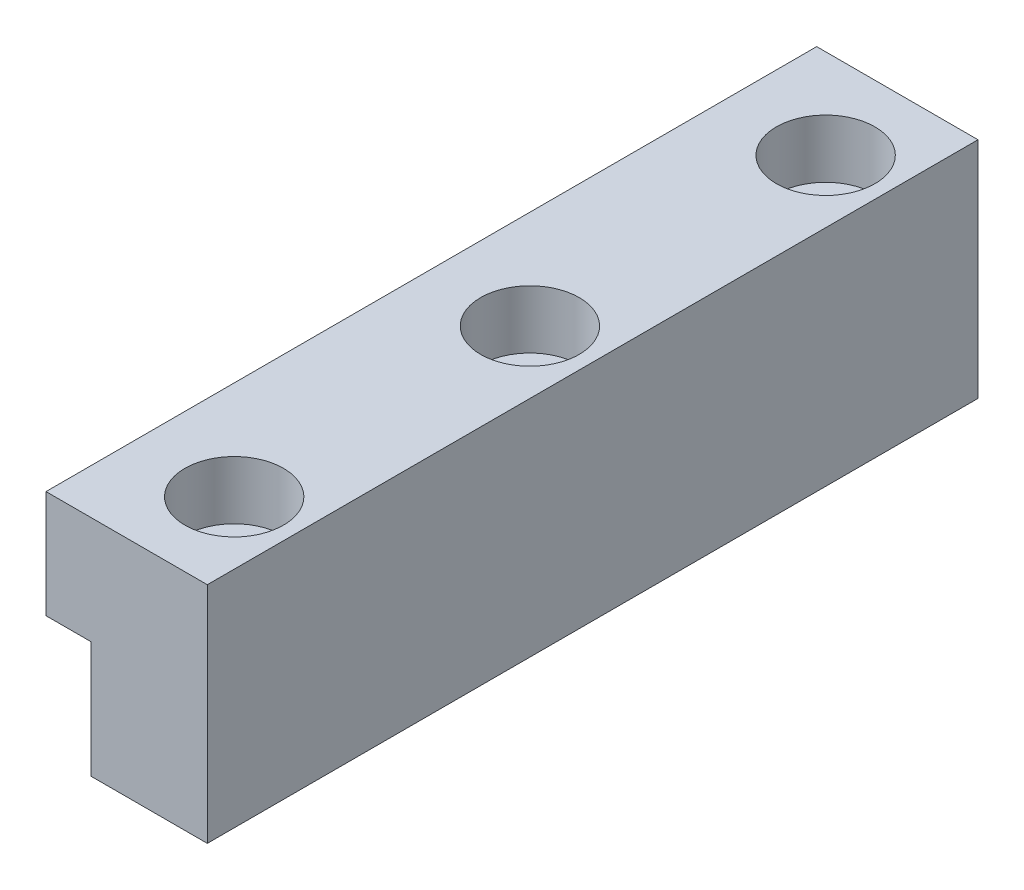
ISO-10303-21;
HEADER;
FILE_DESCRIPTION(('STEP AP214'),'2;1');
FILE_NAME('part.step','',(''),(''),'','','');
FILE_SCHEMA(('AUTOMOTIVE_DESIGN { 1 0 10303 214 1 1 1 1 }'));
ENDSEC;
DATA;
#1=APPLICATION_CONTEXT('core data for automotive mechanical design processes');
#2=APPLICATION_PROTOCOL_DEFINITION('international standard','automotive_design',2000,#1);
#3=PRODUCT_CONTEXT('',#1,'mechanical');
#4=PRODUCT('Part','Part','',(#3));
#5=PRODUCT_RELATED_PRODUCT_CATEGORY('part','',(#4));
#6=PRODUCT_DEFINITION_FORMATION('','',#4);
#7=PRODUCT_DEFINITION_CONTEXT('part definition',#1,'design');
#8=PRODUCT_DEFINITION('design','',#6,#7);
#9=PRODUCT_DEFINITION_SHAPE('','',#8);
#10=(LENGTH_UNIT() NAMED_UNIT(*) SI_UNIT(.MILLI.,.METRE.));
#11=(NAMED_UNIT(*) PLANE_ANGLE_UNIT() SI_UNIT($,.RADIAN.));
#12=(NAMED_UNIT(*) SI_UNIT($,.STERADIAN.) SOLID_ANGLE_UNIT());
#13=UNCERTAINTY_MEASURE_WITH_UNIT(LENGTH_MEASURE(1.E-05),#10,'distance_accuracy_value','');
#14=(GEOMETRIC_REPRESENTATION_CONTEXT(3) GLOBAL_UNCERTAINTY_ASSIGNED_CONTEXT((#13)) GLOBAL_UNIT_ASSIGNED_CONTEXT((#10,
#11,#12)) REPRESENTATION_CONTEXT('',''));
#15=CARTESIAN_POINT('',(0.,0.,0.));
#16=DIRECTION('',(0.,0.,1.));
#17=DIRECTION('',(1.,0.,0.));
#18=AXIS2_PLACEMENT_3D('',#15,#16,#17);
#19=CARTESIAN_POINT('',(51.,-6.5,-32.));
#20=DIRECTION('',(0.,1.,0.));
#21=DIRECTION('',(-1.,0.,0.));
#22=AXIS2_PLACEMENT_3D('',#19,#20,#21);
#23=CYLINDRICAL_SURFACE('',#22,5.5);
#24=CARTESIAN_POINT('',(51.,-6.5,-32.));
#25=DIRECTION('',(0.,1.,0.));
#26=DIRECTION('',(-1.,0.,0.));
#27=AXIS2_PLACEMENT_3D('',#24,#25,#26);
#28=CIRCLE('',#27,5.5);
#29=CARTESIAN_POINT('',(45.5,-6.5,-32.));
#30=VERTEX_POINT('',#29);
#31=EDGE_CURVE('E28',#30,#30,#28,.F.);
#32=ORIENTED_EDGE('',*,*,#31,.T.);
#33=EDGE_LOOP('',(#32));
#34=FACE_BOUND('',#33,.T.);
#35=CARTESIAN_POINT('',(51.,0.,-32.));
#36=DIRECTION('',(0.,1.,0.));
#37=DIRECTION('',(-1.,0.,0.));
#38=AXIS2_PLACEMENT_3D('',#35,#36,#37);
#39=CIRCLE('',#38,5.5);
#40=CARTESIAN_POINT('',(45.5,0.,-32.));
#41=VERTEX_POINT('',#40);
#42=EDGE_CURVE('E91',#41,#41,#39,.F.);
#43=ORIENTED_EDGE('',*,*,#42,.F.);
#44=EDGE_LOOP('',(#43));
#45=FACE_BOUND('',#44,.T.);
#46=ADVANCED_FACE('F24',(#34,#45),#23,.F.);
#47=CARTESIAN_POINT('',(51.,-6.5,-65.));
#48=DIRECTION('',(0.,1.,0.));
#49=DIRECTION('',(-1.,0.,0.));
#50=AXIS2_PLACEMENT_3D('',#47,#48,#49);
#51=CYLINDRICAL_SURFACE('',#50,5.50000000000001);
#52=CARTESIAN_POINT('',(51.,-6.5,-65.));
#53=DIRECTION('',(0.,1.,0.));
#54=DIRECTION('',(-1.,0.,0.));
#55=AXIS2_PLACEMENT_3D('',#52,#53,#54);
#56=CIRCLE('',#55,5.50000000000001);
#57=CARTESIAN_POINT('',(45.5,-6.5,-65.));
#58=VERTEX_POINT('',#57);
#59=EDGE_CURVE('E92',#58,#58,#56,.F.);
#60=ORIENTED_EDGE('',*,*,#59,.T.);
#61=EDGE_LOOP('',(#60));
#62=FACE_BOUND('',#61,.T.);
#63=CARTESIAN_POINT('',(51.,0.,-65.));
#64=DIRECTION('',(0.,1.,0.));
#65=DIRECTION('',(-1.,0.,0.));
#66=AXIS2_PLACEMENT_3D('',#63,#64,#65);
#67=CIRCLE('',#66,5.50000000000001);
#68=CARTESIAN_POINT('',(45.5,0.,-65.));
#69=VERTEX_POINT('',#68);
#70=EDGE_CURVE('E107',#69,#69,#67,.F.);
#71=ORIENTED_EDGE('',*,*,#70,.F.);
#72=EDGE_LOOP('',(#71));
#73=FACE_BOUND('',#72,.T.);
#74=ADVANCED_FACE('F185',(#62,#73),#51,.F.);
#75=CARTESIAN_POINT('',(40.,0.,-108.));
#76=DIRECTION('',(-1.,0.,0.));
#77=DIRECTION('',(0.,-1.,0.));
#78=AXIS2_PLACEMENT_3D('',#75,#76,#77);
#79=PLANE('',#78);
#80=DIRECTION('',(0.,-1.,0.));
#81=VECTOR('',#80,1.);
#82=CARTESIAN_POINT('',(40.,-12.5,-108.));
#83=LINE('',#82,#81);
#84=CARTESIAN_POINT('',(40.,0.,-108.));
#85=VERTEX_POINT('',#84);
#86=CARTESIAN_POINT('',(40.,-12.,-108.));
#87=VERTEX_POINT('',#86);
#88=EDGE_CURVE('E85',#85,#87,#83,.T.);
#89=ORIENTED_EDGE('',*,*,#88,.T.);
#90=DIRECTION('',(0.,0.,-1.));
#91=VECTOR('',#90,1.);
#92=CARTESIAN_POINT('',(40.,-12.,-65.));
#93=LINE('',#92,#91);
#94=CARTESIAN_POINT('',(40.,-12.,-22.));
#95=VERTEX_POINT('',#94);
#96=EDGE_CURVE('E76',#95,#87,#93,.T.);
#97=ORIENTED_EDGE('',*,*,#96,.F.);
#98=DIRECTION('',(0.,-1.,0.));
#99=VECTOR('',#98,1.);
#100=CARTESIAN_POINT('',(40.,-12.5,-22.));
#101=LINE('',#100,#99);
#102=CARTESIAN_POINT('',(40.,0.,-22.));
#103=VERTEX_POINT('',#102);
#104=EDGE_CURVE('E86',#103,#95,#101,.T.);
#105=ORIENTED_EDGE('',*,*,#104,.F.);
#106=DIRECTION('',(0.,0.,1.));
#107=VECTOR('',#106,1.);
#108=CARTESIAN_POINT('',(40.,0.,-65.));
#109=LINE('',#108,#107);
#110=EDGE_CURVE('E82',#85,#103,#109,.T.);
#111=ORIENTED_EDGE('',*,*,#110,.F.);
#112=EDGE_LOOP('',(#89,#97,#105,#111));
#113=FACE_BOUND('',#112,.T.);
#114=ADVANCED_FACE('F84',(#113),#79,.T.);
#115=CARTESIAN_POINT('',(40.,-12.,-108.));
#116=DIRECTION('',(0.,-1.,0.));
#117=DIRECTION('',(1.,0.,0.));
#118=AXIS2_PLACEMENT_3D('',#115,#116,#117);
#119=PLANE('',#118);
#120=DIRECTION('',(1.,0.,0.));
#121=VECTOR('',#120,1.);
#122=CARTESIAN_POINT('',(49.,-12.,-108.));
#123=LINE('',#122,#121);
#124=CARTESIAN_POINT('',(45.000000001,-12.,-108.));
#125=VERTEX_POINT('',#124);
#126=EDGE_CURVE('E100',#87,#125,#123,.T.);
#127=ORIENTED_EDGE('',*,*,#126,.T.);
#128=DIRECTION('',(0.,0.,-1.));
#129=VECTOR('',#128,1.);
#130=CARTESIAN_POINT('',(45.,-12.,-65.));
#131=LINE('',#130,#129);
#132=CARTESIAN_POINT('',(45.000000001,-12.,-22.));
#133=VERTEX_POINT('',#132);
#134=EDGE_CURVE('E105',#133,#125,#131,.T.);
#135=ORIENTED_EDGE('',*,*,#134,.F.);
#136=DIRECTION('',(1.,0.,0.));
#137=VECTOR('',#136,1.);
#138=CARTESIAN_POINT('',(49.,-12.,-22.));
#139=LINE('',#138,#137);
#140=EDGE_CURVE('E281',#95,#133,#139,.T.);
#141=ORIENTED_EDGE('',*,*,#140,.F.);
#142=ORIENTED_EDGE('',*,*,#96,.T.);
#143=EDGE_LOOP('',(#127,#135,#141,#142));
#144=FACE_BOUND('',#143,.T.);
#145=ADVANCED_FACE('F149',(#144),#119,.T.);
#146=CARTESIAN_POINT('',(56.566,-6.5,-37.566));
#147=DIRECTION('',(0.,-1.,0.));
#148=DIRECTION('',(0.,0.,1.));
#149=AXIS2_PLACEMENT_3D('',#146,#147,#148);
#150=PLANE('',#149);
#151=CARTESIAN_POINT('',(51.,-6.5,-32.));
#152=DIRECTION('',(0.,1.,0.));
#153=DIRECTION('',(0.,0.,1.));
#154=AXIS2_PLACEMENT_3D('',#151,#152,#153);
#155=CIRCLE('',#154,3.5);
#156=CARTESIAN_POINT('',(51.,-6.5,-28.5));
#157=VERTEX_POINT('',#156);
#158=EDGE_CURVE('E131',#157,#157,#155,.T.);
#159=ORIENTED_EDGE('',*,*,#158,.F.);
#160=EDGE_LOOP('',(#159));
#161=FACE_BOUND('',#160,.T.);
#162=ORIENTED_EDGE('',*,*,#31,.F.);
#163=EDGE_LOOP('',(#162));
#164=FACE_BOUND('',#163,.T.);
#165=ADVANCED_FACE('F146',(#161,#164),#150,.F.);
#166=CARTESIAN_POINT('',(56.566,-6.5,-70.566));
#167=DIRECTION('',(0.,-1.,0.));
#168=DIRECTION('',(0.,0.,1.));
#169=AXIS2_PLACEMENT_3D('',#166,#167,#168);
#170=PLANE('',#169);
#171=CARTESIAN_POINT('',(51.,-6.5,-65.));
#172=DIRECTION('',(0.,1.,0.));
#173=DIRECTION('',(0.,0.,1.));
#174=AXIS2_PLACEMENT_3D('',#171,#172,#173);
#175=CIRCLE('',#174,3.5);
#176=CARTESIAN_POINT('',(51.,-6.5,-61.5));
#177=VERTEX_POINT('',#176);
#178=EDGE_CURVE('E128',#177,#177,#175,.T.);
#179=ORIENTED_EDGE('',*,*,#178,.F.);
#180=EDGE_LOOP('',(#179));
#181=FACE_BOUND('',#180,.T.);
#182=ORIENTED_EDGE('',*,*,#59,.F.);
#183=EDGE_LOOP('',(#182));
#184=FACE_BOUND('',#183,.T.);
#185=ADVANCED_FACE('F148',(#181,#184),#170,.F.);
#186=CARTESIAN_POINT('',(58.,0.,-108.));
#187=DIRECTION('',(0.,1.,0.));
#188=DIRECTION('',(-1.,0.,0.));
#189=AXIS2_PLACEMENT_3D('',#186,#187,#188);
#190=PLANE('',#189);
#191=CARTESIAN_POINT('',(51.,0.,-98.));
#192=DIRECTION('',(0.,1.,0.));
#193=DIRECTION('',(-1.,0.,0.));
#194=AXIS2_PLACEMENT_3D('',#191,#192,#193);
#195=CIRCLE('',#194,5.50000000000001);
#196=CARTESIAN_POINT('',(45.5,0.,-98.));
#197=VERTEX_POINT('',#196);
#198=EDGE_CURVE('E124',#197,#197,#195,.T.);
#199=ORIENTED_EDGE('',*,*,#198,.F.);
#200=EDGE_LOOP('',(#199));
#201=FACE_BOUND('',#200,.T.);
#202=ORIENTED_EDGE('',*,*,#70,.T.);
#203=EDGE_LOOP('',(#202));
#204=FACE_BOUND('',#203,.T.);
#205=ORIENTED_EDGE('',*,*,#42,.T.);
#206=EDGE_LOOP('',(#205));
#207=FACE_BOUND('',#206,.T.);
#208=ORIENTED_EDGE('',*,*,#110,.T.);
#209=DIRECTION('',(-1.,0.,0.));
#210=VECTOR('',#209,1.);
#211=CARTESIAN_POINT('',(49.,0.,-22.));
#212=LINE('',#211,#210);
#213=CARTESIAN_POINT('',(58.,0.,-22.));
#214=VERTEX_POINT('',#213);
#215=EDGE_CURVE('E293',#214,#103,#212,.T.);
#216=ORIENTED_EDGE('',*,*,#215,.F.);
#217=DIRECTION('',(0.,0.,1.));
#218=VECTOR('',#217,1.);
#219=CARTESIAN_POINT('',(58.,0.,-65.));
#220=LINE('',#219,#218);
#221=CARTESIAN_POINT('',(58.,0.,-108.));
#222=VERTEX_POINT('',#221);
#223=EDGE_CURVE('E104',#222,#214,#220,.T.);
#224=ORIENTED_EDGE('',*,*,#223,.F.);
#225=DIRECTION('',(-1.,0.,0.));
#226=VECTOR('',#225,1.);
#227=CARTESIAN_POINT('',(49.,0.,-108.));
#228=LINE('',#227,#226);
#229=EDGE_CURVE('E97',#222,#85,#228,.T.);
#230=ORIENTED_EDGE('',*,*,#229,.T.);
#231=EDGE_LOOP('',(#208,#216,#224,#230));
#232=FACE_BOUND('',#231,.T.);
#233=ADVANCED_FACE('F103',(#201,#204,#207,#232),#190,.T.);
#234=CARTESIAN_POINT('',(45.,-12.,-108.));
#235=DIRECTION('',(-1.,0.,0.));
#236=DIRECTION('',(0.,-1.,0.));
#237=AXIS2_PLACEMENT_3D('',#234,#235,#236);
#238=PLANE('',#237);
#239=DIRECTION('',(0.,0.,-1.));
#240=VECTOR('',#239,1.);
#241=CARTESIAN_POINT('',(45.,-25.,-65.));
#242=LINE('',#241,#240);
#243=CARTESIAN_POINT('',(45.000000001,-25.,-22.));
#244=VERTEX_POINT('',#243);
#245=CARTESIAN_POINT('',(45.000000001,-25.,-108.));
#246=VERTEX_POINT('',#245);
#247=EDGE_CURVE('E127',#244,#246,#242,.T.);
#248=ORIENTED_EDGE('',*,*,#247,.F.);
#249=DIRECTION('',(0.,-1.,0.));
#250=VECTOR('',#249,1.);
#251=CARTESIAN_POINT('',(45.000000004,-12.5,-22.));
#252=LINE('',#251,#250);
#253=EDGE_CURVE('E134',#133,#244,#252,.T.);
#254=ORIENTED_EDGE('',*,*,#253,.F.);
#255=ORIENTED_EDGE('',*,*,#134,.T.);
#256=DIRECTION('',(0.,-1.,0.));
#257=VECTOR('',#256,1.);
#258=CARTESIAN_POINT('',(45.000000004,-12.5,-108.));
#259=LINE('',#258,#257);
#260=EDGE_CURVE('E301',#125,#246,#259,.T.);
#261=ORIENTED_EDGE('',*,*,#260,.T.);
#262=EDGE_LOOP('',(#248,#254,#255,#261));
#263=FACE_BOUND('',#262,.T.);
#264=ADVANCED_FACE('F217',(#263),#238,.T.);
#265=CARTESIAN_POINT('',(58.,-25.,-108.));
#266=DIRECTION('',(0.,0.,1.));
#267=DIRECTION('',(0.,1.,0.));
#268=AXIS2_PLACEMENT_3D('',#265,#266,#267);
#269=PLANE('',#268);
#270=ORIENTED_EDGE('',*,*,#126,.F.);
#271=ORIENTED_EDGE('',*,*,#88,.F.);
#272=ORIENTED_EDGE('',*,*,#229,.F.);
#273=DIRECTION('',(0.,1.,0.));
#274=VECTOR('',#273,1.);
#275=CARTESIAN_POINT('',(58.,-12.5,-108.));
#276=LINE('',#275,#274);
#277=CARTESIAN_POINT('',(58.,-25.,-108.));
#278=VERTEX_POINT('',#277);
#279=EDGE_CURVE('E299',#278,#222,#276,.T.);
#280=ORIENTED_EDGE('',*,*,#279,.F.);
#281=DIRECTION('',(1.,0.,0.));
#282=VECTOR('',#281,1.);
#283=CARTESIAN_POINT('',(51.5,-25.,-108.));
#284=LINE('',#283,#282);
#285=EDGE_CURVE('E303',#246,#278,#284,.T.);
#286=ORIENTED_EDGE('',*,*,#285,.F.);
#287=ORIENTED_EDGE('',*,*,#260,.F.);
#288=EDGE_LOOP('',(#270,#271,#272,#280,#286,#287));
#289=FACE_BOUND('',#288,.T.);
#290=ADVANCED_FACE('F95',(#289),#269,.F.);
#291=CARTESIAN_POINT('',(58.,-25.,-22.));
#292=DIRECTION('',(1.,0.,0.));
#293=DIRECTION('',(0.,0.,-1.));
#294=AXIS2_PLACEMENT_3D('',#291,#292,#293);
#295=PLANE('',#294);
#296=ORIENTED_EDGE('',*,*,#223,.T.);
#297=DIRECTION('',(0.,1.,0.));
#298=VECTOR('',#297,1.);
#299=CARTESIAN_POINT('',(58.,-12.5,-22.));
#300=LINE('',#299,#298);
#301=CARTESIAN_POINT('',(58.,-25.,-22.));
#302=VERTEX_POINT('',#301);
#303=EDGE_CURVE('E295',#302,#214,#300,.T.);
#304=ORIENTED_EDGE('',*,*,#303,.F.);
#305=DIRECTION('',(0.,0.,1.));
#306=VECTOR('',#305,1.);
#307=CARTESIAN_POINT('',(58.,-25.,-65.));
#308=LINE('',#307,#306);
#309=EDGE_CURVE('E43',#278,#302,#308,.T.);
#310=ORIENTED_EDGE('',*,*,#309,.F.);
#311=ORIENTED_EDGE('',*,*,#279,.T.);
#312=EDGE_LOOP('',(#296,#304,#310,#311));
#313=FACE_BOUND('',#312,.T.);
#314=ADVANCED_FACE('F232',(#313),#295,.T.);
#315=CARTESIAN_POINT('',(58.,-25.,-22.));
#316=DIRECTION('',(0.,0.,1.));
#317=DIRECTION('',(0.,1.,0.));
#318=AXIS2_PLACEMENT_3D('',#315,#316,#317);
#319=PLANE('',#318);
#320=ORIENTED_EDGE('',*,*,#140,.T.);
#321=ORIENTED_EDGE('',*,*,#253,.T.);
#322=DIRECTION('',(-1.,0.,0.));
#323=VECTOR('',#322,1.);
#324=CARTESIAN_POINT('',(51.5,-25.,-22.));
#325=LINE('',#324,#323);
#326=EDGE_CURVE('E123',#302,#244,#325,.T.);
#327=ORIENTED_EDGE('',*,*,#326,.F.);
#328=ORIENTED_EDGE('',*,*,#303,.T.);
#329=ORIENTED_EDGE('',*,*,#215,.T.);
#330=ORIENTED_EDGE('',*,*,#104,.T.);
#331=EDGE_LOOP('',(#320,#321,#327,#328,#329,#330));
#332=FACE_BOUND('',#331,.T.);
#333=ADVANCED_FACE('F183',(#332),#319,.T.);
#334=CARTESIAN_POINT('',(51.,-25.,-32.));
#335=DIRECTION('',(0.,1.,0.));
#336=DIRECTION('',(0.,0.,1.));
#337=AXIS2_PLACEMENT_3D('',#334,#335,#336);
#338=CYLINDRICAL_SURFACE('',#337,3.5);
#339=CARTESIAN_POINT('',(51.,-25.,-32.));
#340=DIRECTION('',(0.,1.,0.));
#341=DIRECTION('',(0.,0.,1.));
#342=AXIS2_PLACEMENT_3D('',#339,#340,#341);
#343=CIRCLE('',#342,3.5);
#344=CARTESIAN_POINT('',(51.,-25.,-28.5));
#345=VERTEX_POINT('',#344);
#346=EDGE_CURVE('E120',#345,#345,#343,.T.);
#347=ORIENTED_EDGE('',*,*,#346,.F.);
#348=EDGE_LOOP('',(#347));
#349=FACE_BOUND('',#348,.T.);
#350=ORIENTED_EDGE('',*,*,#158,.T.);
#351=EDGE_LOOP('',(#350));
#352=FACE_BOUND('',#351,.T.);
#353=ADVANCED_FACE('F179',(#349,#352),#338,.F.);
#354=CARTESIAN_POINT('',(51.,-25.,-65.));
#355=DIRECTION('',(0.,1.,0.));
#356=DIRECTION('',(0.,0.,1.));
#357=AXIS2_PLACEMENT_3D('',#354,#355,#356);
#358=CYLINDRICAL_SURFACE('',#357,3.5);
#359=CARTESIAN_POINT('',(51.,-25.,-65.));
#360=DIRECTION('',(0.,1.,0.));
#361=DIRECTION('',(0.,0.,1.));
#362=AXIS2_PLACEMENT_3D('',#359,#360,#361);
#363=CIRCLE('',#362,3.5);
#364=CARTESIAN_POINT('',(51.,-25.,-61.5));
#365=VERTEX_POINT('',#364);
#366=EDGE_CURVE('E117',#365,#365,#363,.T.);
#367=ORIENTED_EDGE('',*,*,#366,.F.);
#368=EDGE_LOOP('',(#367));
#369=FACE_BOUND('',#368,.T.);
#370=ORIENTED_EDGE('',*,*,#178,.T.);
#371=EDGE_LOOP('',(#370));
#372=FACE_BOUND('',#371,.T.);
#373=ADVANCED_FACE('F175',(#369,#372),#358,.F.);
#374=CARTESIAN_POINT('',(51.,-6.5,-98.));
#375=DIRECTION('',(0.,1.,0.));
#376=DIRECTION('',(-1.,0.,0.));
#377=AXIS2_PLACEMENT_3D('',#374,#375,#376);
#378=CYLINDRICAL_SURFACE('',#377,5.50000000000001);
#379=CARTESIAN_POINT('',(51.,-6.5,-98.));
#380=DIRECTION('',(0.,1.,0.));
#381=DIRECTION('',(-1.,0.,0.));
#382=AXIS2_PLACEMENT_3D('',#379,#380,#381);
#383=CIRCLE('',#382,5.50000000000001);
#384=CARTESIAN_POINT('',(45.5,-6.5,-98.));
#385=VERTEX_POINT('',#384);
#386=EDGE_CURVE('E114',#385,#385,#383,.F.);
#387=ORIENTED_EDGE('',*,*,#386,.T.);
#388=EDGE_LOOP('',(#387));
#389=FACE_BOUND('',#388,.T.);
#390=ORIENTED_EDGE('',*,*,#198,.T.);
#391=EDGE_LOOP('',(#390));
#392=FACE_BOUND('',#391,.T.);
#393=ADVANCED_FACE('F172',(#389,#392),#378,.F.);
#394=CARTESIAN_POINT('',(45.,-25.,-108.));
#395=DIRECTION('',(0.,-1.,0.));
#396=DIRECTION('',(1.,0.,0.));
#397=AXIS2_PLACEMENT_3D('',#394,#395,#396);
#398=PLANE('',#397);
#399=ORIENTED_EDGE('',*,*,#366,.T.);
#400=EDGE_LOOP('',(#399));
#401=FACE_BOUND('',#400,.T.);
#402=ORIENTED_EDGE('',*,*,#346,.T.);
#403=EDGE_LOOP('',(#402));
#404=FACE_BOUND('',#403,.T.);
#405=CARTESIAN_POINT('',(51.,-25.,-98.));
#406=DIRECTION('',(0.,1.,0.));
#407=DIRECTION('',(0.,0.,1.));
#408=AXIS2_PLACEMENT_3D('',#405,#406,#407);
#409=CIRCLE('',#408,3.5);
#410=CARTESIAN_POINT('',(51.,-25.,-94.5));
#411=VERTEX_POINT('',#410);
#412=EDGE_CURVE('E34',#411,#411,#409,.F.);
#413=ORIENTED_EDGE('',*,*,#412,.F.);
#414=EDGE_LOOP('',(#413));
#415=FACE_BOUND('',#414,.T.);
#416=ORIENTED_EDGE('',*,*,#309,.T.);
#417=ORIENTED_EDGE('',*,*,#326,.T.);
#418=ORIENTED_EDGE('',*,*,#247,.T.);
#419=ORIENTED_EDGE('',*,*,#285,.T.);
#420=EDGE_LOOP('',(#416,#417,#418,#419));
#421=FACE_BOUND('',#420,.T.);
#422=ADVANCED_FACE('F168',(#401,#404,#415,#421),#398,.T.);
#423=CARTESIAN_POINT('',(56.566,-6.5,-103.566));
#424=DIRECTION('',(0.,-1.,0.));
#425=DIRECTION('',(0.,0.,1.));
#426=AXIS2_PLACEMENT_3D('',#423,#424,#425);
#427=PLANE('',#426);
#428=CARTESIAN_POINT('',(51.,-6.5,-98.));
#429=DIRECTION('',(0.,1.,0.));
#430=DIRECTION('',(0.,0.,1.));
#431=AXIS2_PLACEMENT_3D('',#428,#429,#430);
#432=CIRCLE('',#431,3.5);
#433=CARTESIAN_POINT('',(51.,-6.5,-94.5));
#434=VERTEX_POINT('',#433);
#435=EDGE_CURVE('E13',#434,#434,#432,.T.);
#436=ORIENTED_EDGE('',*,*,#435,.F.);
#437=EDGE_LOOP('',(#436));
#438=FACE_BOUND('',#437,.T.);
#439=ORIENTED_EDGE('',*,*,#386,.F.);
#440=EDGE_LOOP('',(#439));
#441=FACE_BOUND('',#440,.T.);
#442=ADVANCED_FACE('F26',(#438,#441),#427,.F.);
#443=CARTESIAN_POINT('',(51.,-25.,-98.));
#444=DIRECTION('',(0.,1.,0.));
#445=DIRECTION('',(0.,0.,1.));
#446=AXIS2_PLACEMENT_3D('',#443,#444,#445);
#447=CYLINDRICAL_SURFACE('',#446,3.5);
#448=ORIENTED_EDGE('',*,*,#435,.T.);
#449=EDGE_LOOP('',(#448));
#450=FACE_BOUND('',#449,.T.);
#451=ORIENTED_EDGE('',*,*,#412,.T.);
#452=EDGE_LOOP('',(#451));
#453=FACE_BOUND('',#452,.T.);
#454=ADVANCED_FACE('F161',(#450,#453),#447,.F.);
#455=CLOSED_SHELL('',(#46,#74,#114,#145,#165,#185,#233,#264,#290,#314,#333,#353,#373,#393,#422,
#442,#454));
#456=MANIFOLD_SOLID_BREP('B1',#455);
#457=ADVANCED_BREP_SHAPE_REPRESENTATION('',(#18,#456),#14);
#458=SHAPE_DEFINITION_REPRESENTATION(#9,#457);
ENDSEC;
END-ISO-10303-21;
